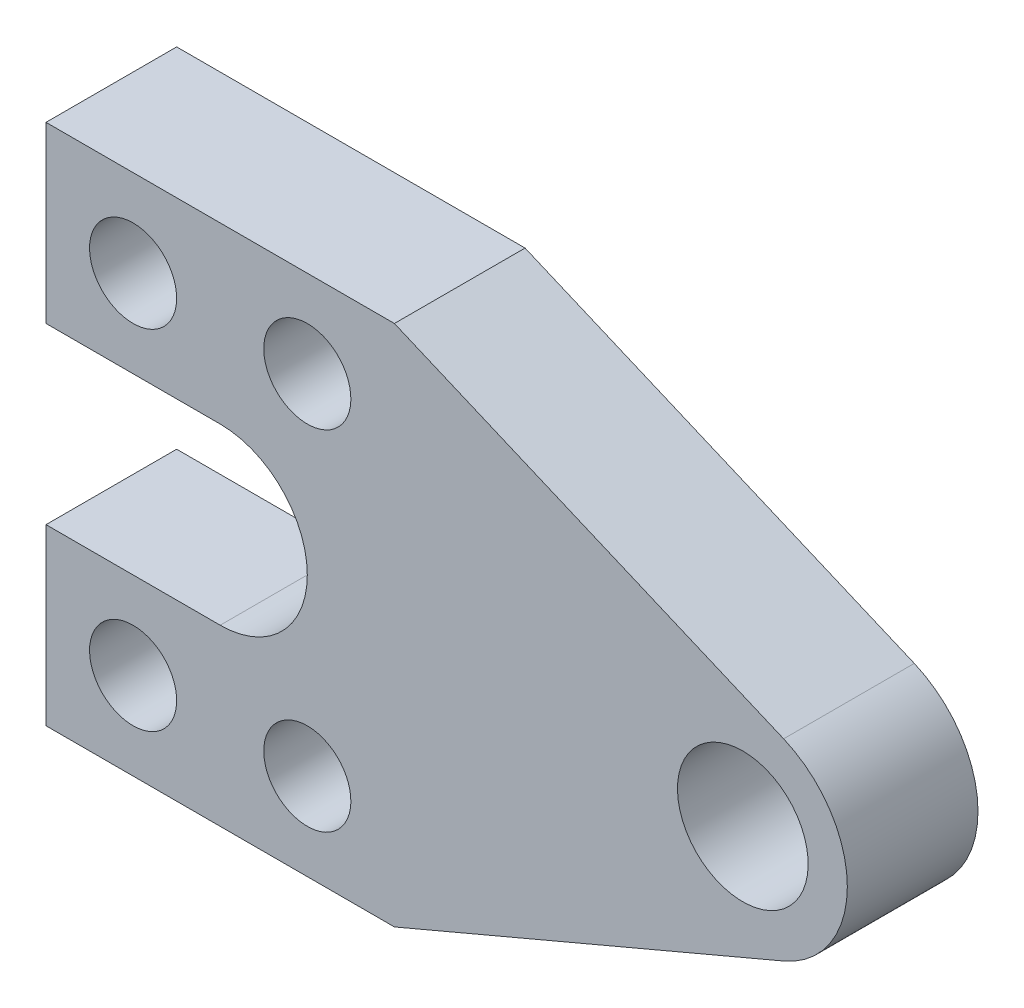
ISO-10303-21;
HEADER;
FILE_DESCRIPTION(('STEP AP214'),'2;1');
FILE_NAME('part.step','',(''),(''),'','','');
FILE_SCHEMA(('AUTOMOTIVE_DESIGN { 1 0 10303 214 1 1 1 1 }'));
ENDSEC;
DATA;
#1=APPLICATION_CONTEXT('core data for automotive mechanical design processes');
#2=APPLICATION_PROTOCOL_DEFINITION('international standard','automotive_design',2000,#1);
#3=PRODUCT_CONTEXT('',#1,'mechanical');
#4=PRODUCT('Part','Part','',(#3));
#5=PRODUCT_RELATED_PRODUCT_CATEGORY('part','',(#4));
#6=PRODUCT_DEFINITION_FORMATION('','',#4);
#7=PRODUCT_DEFINITION_CONTEXT('part definition',#1,'design');
#8=PRODUCT_DEFINITION('design','',#6,#7);
#9=PRODUCT_DEFINITION_SHAPE('','',#8);
#10=(LENGTH_UNIT() NAMED_UNIT(*) SI_UNIT(.MILLI.,.METRE.));
#11=(NAMED_UNIT(*) PLANE_ANGLE_UNIT() SI_UNIT($,.RADIAN.));
#12=(NAMED_UNIT(*) SI_UNIT($,.STERADIAN.) SOLID_ANGLE_UNIT());
#13=UNCERTAINTY_MEASURE_WITH_UNIT(LENGTH_MEASURE(1.E-05),#10,'distance_accuracy_value','');
#14=(GEOMETRIC_REPRESENTATION_CONTEXT(3) GLOBAL_UNCERTAINTY_ASSIGNED_CONTEXT((#13)) GLOBAL_UNIT_ASSIGNED_CONTEXT((#10,
#11,#12)) REPRESENTATION_CONTEXT('',''));
#15=CARTESIAN_POINT('',(0.,0.,0.));
#16=DIRECTION('',(0.,0.,1.));
#17=DIRECTION('',(1.,0.,0.));
#18=AXIS2_PLACEMENT_3D('',#15,#16,#17);
#19=CARTESIAN_POINT('',(9.99999999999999,-9.99999999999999,-7.5));
#20=DIRECTION('',(1.,0.,0.));
#21=DIRECTION('',(0.,1.,0.));
#22=AXIS2_PLACEMENT_3D('',#19,#20,#21);
#23=PLANE('',#22);
#24=DIRECTION('',(0.,1.,0.));
#25=VECTOR('',#24,1.);
#26=CARTESIAN_POINT('',(9.99999999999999,-9.99999999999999,7.5));
#27=LINE('',#26,#25);
#28=CARTESIAN_POINT('',(10.,-30.,7.5));
#29=VERTEX_POINT('',#28);
#30=CARTESIAN_POINT('',(9.99999999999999,-9.99999999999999,7.5));
#31=VERTEX_POINT('',#30);
#32=EDGE_CURVE('E142',#29,#31,#27,.T.);
#33=ORIENTED_EDGE('',*,*,#32,.T.);
#34=DIRECTION('',(0.,0.,1.));
#35=VECTOR('',#34,1.);
#36=CARTESIAN_POINT('',(9.99999999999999,-9.99999999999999,-7.5));
#37=LINE('',#36,#35);
#38=CARTESIAN_POINT('',(9.99999999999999,-9.99999999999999,-7.5));
#39=VERTEX_POINT('',#38);
#40=EDGE_CURVE('E180',#39,#31,#37,.T.);
#41=ORIENTED_EDGE('',*,*,#40,.F.);
#42=DIRECTION('',(0.,1.,0.));
#43=VECTOR('',#42,1.);
#44=CARTESIAN_POINT('',(9.99999999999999,-9.99999999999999,-7.5));
#45=LINE('',#44,#43);
#46=CARTESIAN_POINT('',(10.,-30.,-7.5));
#47=VERTEX_POINT('',#46);
#48=EDGE_CURVE('E161',#47,#39,#45,.T.);
#49=ORIENTED_EDGE('',*,*,#48,.F.);
#50=DIRECTION('',(0.,0.,1.));
#51=VECTOR('',#50,1.);
#52=CARTESIAN_POINT('',(10.,-30.,-7.5));
#53=LINE('',#52,#51);
#54=EDGE_CURVE('E138',#47,#29,#53,.T.);
#55=ORIENTED_EDGE('',*,*,#54,.T.);
#56=EDGE_LOOP('',(#33,#41,#49,#55));
#57=FACE_BOUND('',#56,.T.);
#58=ADVANCED_FACE('F31',(#57),#23,.F.);
#59=CARTESIAN_POINT('',(50.,-9.99999999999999,-7.5));
#60=DIRECTION('',(0.,-1.,0.));
#61=DIRECTION('',(1.,0.,0.));
#62=AXIS2_PLACEMENT_3D('',#59,#60,#61);
#63=PLANE('',#62);
#64=DIRECTION('',(1.,0.,0.));
#65=VECTOR('',#64,1.);
#66=CARTESIAN_POINT('',(50.,-9.99999999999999,7.5));
#67=LINE('',#66,#65);
#68=CARTESIAN_POINT('',(50.,-9.99999999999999,7.5));
#69=VERTEX_POINT('',#68);
#70=EDGE_CURVE('E145',#31,#69,#67,.T.);
#71=ORIENTED_EDGE('',*,*,#70,.T.);
#72=DIRECTION('',(0.,0.,1.));
#73=VECTOR('',#72,1.);
#74=CARTESIAN_POINT('',(50.,-9.99999999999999,-7.5));
#75=LINE('',#74,#73);
#76=CARTESIAN_POINT('',(50.,-9.99999999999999,-7.5));
#77=VERTEX_POINT('',#76);
#78=EDGE_CURVE('E177',#77,#69,#75,.T.);
#79=ORIENTED_EDGE('',*,*,#78,.F.);
#80=DIRECTION('',(1.,0.,0.));
#81=VECTOR('',#80,1.);
#82=CARTESIAN_POINT('',(50.,-9.99999999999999,-7.5));
#83=LINE('',#82,#81);
#84=EDGE_CURVE('E98',#39,#77,#83,.T.);
#85=ORIENTED_EDGE('',*,*,#84,.F.);
#86=ORIENTED_EDGE('',*,*,#40,.T.);
#87=EDGE_LOOP('',(#71,#79,#85,#86));
#88=FACE_BOUND('',#87,.T.);
#89=ADVANCED_FACE('F209',(#88),#63,.F.);
#90=CARTESIAN_POINT('',(94.6855647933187,-28.9525802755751,-7.5));
#91=DIRECTION('',(-0.390463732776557,-0.920618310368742,0.));
#92=DIRECTION('',(0.920618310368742,-0.390463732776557,0.));
#93=AXIS2_PLACEMENT_3D('',#90,#91,#92);
#94=PLANE('',#93);
#95=DIRECTION('',(0.920618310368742,-0.390463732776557,0.));
#96=VECTOR('',#95,1.);
#97=CARTESIAN_POINT('',(94.6855647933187,-28.9525802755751,7.5));
#98=LINE('',#97,#96);
#99=CARTESIAN_POINT('',(94.6855647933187,-28.9525802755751,7.5));
#100=VERTEX_POINT('',#99);
#101=EDGE_CURVE('E148',#69,#100,#98,.T.);
#102=ORIENTED_EDGE('',*,*,#101,.T.);
#103=DIRECTION('',(0.,0.,1.));
#104=VECTOR('',#103,1.);
#105=CARTESIAN_POINT('',(94.6855647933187,-28.9525802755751,-7.5));
#106=LINE('',#105,#104);
#107=CARTESIAN_POINT('',(94.6855647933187,-28.9525802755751,-7.5));
#108=VERTEX_POINT('',#107);
#109=EDGE_CURVE('E174',#108,#100,#106,.T.);
#110=ORIENTED_EDGE('',*,*,#109,.F.);
#111=DIRECTION('',(0.920618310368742,-0.390463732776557,0.));
#112=VECTOR('',#111,1.);
#113=CARTESIAN_POINT('',(94.6855647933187,-28.9525802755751,-7.5));
#114=LINE('',#113,#112);
#115=EDGE_CURVE('E267',#77,#108,#114,.T.);
#116=ORIENTED_EDGE('',*,*,#115,.F.);
#117=ORIENTED_EDGE('',*,*,#78,.T.);
#118=EDGE_LOOP('',(#102,#110,#116,#117));
#119=FACE_BOUND('',#118,.T.);
#120=ADVANCED_FACE('F215',(#119),#94,.F.);
#121=CARTESIAN_POINT('',(90.,-40.,-7.5));
#122=DIRECTION('',(0.,0.,1.));
#123=DIRECTION('',(1.,0.,0.));
#124=AXIS2_PLACEMENT_3D('',#121,#122,#123);
#125=CYLINDRICAL_SURFACE('',#124,12.);
#126=CARTESIAN_POINT('',(90.,-40.,7.5));
#127=DIRECTION('',(0.,0.,-1.));
#128=DIRECTION('',(1.,0.,0.));
#129=AXIS2_PLACEMENT_3D('',#126,#127,#128);
#130=CIRCLE('',#129,12.);
#131=CARTESIAN_POINT('',(94.6855647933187,-51.0474197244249,7.5));
#132=VERTEX_POINT('',#131);
#133=EDGE_CURVE('E150',#100,#132,#130,.T.);
#134=ORIENTED_EDGE('',*,*,#133,.T.);
#135=DIRECTION('',(0.,0.,1.));
#136=VECTOR('',#135,1.);
#137=CARTESIAN_POINT('',(94.6855647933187,-51.0474197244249,-7.5));
#138=LINE('',#137,#136);
#139=CARTESIAN_POINT('',(94.6855647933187,-51.0474197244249,-7.5));
#140=VERTEX_POINT('',#139);
#141=EDGE_CURVE('E171',#140,#132,#138,.T.);
#142=ORIENTED_EDGE('',*,*,#141,.F.);
#143=CARTESIAN_POINT('',(90.,-40.,-7.5));
#144=DIRECTION('',(0.,0.,-1.));
#145=DIRECTION('',(1.,0.,0.));
#146=AXIS2_PLACEMENT_3D('',#143,#144,#145);
#147=CIRCLE('',#146,12.);
#148=EDGE_CURVE('E269',#108,#140,#147,.T.);
#149=ORIENTED_EDGE('',*,*,#148,.F.);
#150=ORIENTED_EDGE('',*,*,#109,.T.);
#151=EDGE_LOOP('',(#134,#142,#149,#150));
#152=FACE_BOUND('',#151,.T.);
#153=ADVANCED_FACE('F296',(#152),#125,.T.);
#154=CARTESIAN_POINT('',(50.,-70.,-7.5));
#155=DIRECTION('',(-0.390463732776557,0.920618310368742,0.));
#156=DIRECTION('',(-0.920618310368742,-0.390463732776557,0.));
#157=AXIS2_PLACEMENT_3D('',#154,#155,#156);
#158=PLANE('',#157);
#159=DIRECTION('',(-0.920618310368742,-0.390463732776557,0.));
#160=VECTOR('',#159,1.);
#161=CARTESIAN_POINT('',(50.,-70.,7.5));
#162=LINE('',#161,#160);
#163=CARTESIAN_POINT('',(50.,-70.,7.5));
#164=VERTEX_POINT('',#163);
#165=EDGE_CURVE('E152',#132,#164,#162,.T.);
#166=ORIENTED_EDGE('',*,*,#165,.T.);
#167=DIRECTION('',(0.,0.,1.));
#168=VECTOR('',#167,1.);
#169=CARTESIAN_POINT('',(50.,-70.,-7.5));
#170=LINE('',#169,#168);
#171=CARTESIAN_POINT('',(50.,-70.,-7.5));
#172=VERTEX_POINT('',#171);
#173=EDGE_CURVE('E168',#172,#164,#170,.T.);
#174=ORIENTED_EDGE('',*,*,#173,.F.);
#175=DIRECTION('',(-0.920618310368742,-0.390463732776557,0.));
#176=VECTOR('',#175,1.);
#177=CARTESIAN_POINT('',(50.,-70.,-7.5));
#178=LINE('',#177,#176);
#179=EDGE_CURVE('E271',#140,#172,#178,.T.);
#180=ORIENTED_EDGE('',*,*,#179,.F.);
#181=ORIENTED_EDGE('',*,*,#141,.T.);
#182=EDGE_LOOP('',(#166,#174,#180,#181));
#183=FACE_BOUND('',#182,.T.);
#184=ADVANCED_FACE('F299',(#183),#158,.F.);
#185=CARTESIAN_POINT('',(9.99999999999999,-70.,-7.5));
#186=DIRECTION('',(0.,1.,0.));
#187=DIRECTION('',(0.,0.,1.));
#188=AXIS2_PLACEMENT_3D('',#185,#186,#187);
#189=PLANE('',#188);
#190=DIRECTION('',(-1.,0.,0.));
#191=VECTOR('',#190,1.);
#192=CARTESIAN_POINT('',(9.99999999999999,-70.,7.5));
#193=LINE('',#192,#191);
#194=CARTESIAN_POINT('',(9.99999999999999,-70.,7.5));
#195=VERTEX_POINT('',#194);
#196=EDGE_CURVE('E154',#164,#195,#193,.T.);
#197=ORIENTED_EDGE('',*,*,#196,.T.);
#198=DIRECTION('',(0.,0.,1.));
#199=VECTOR('',#198,1.);
#200=CARTESIAN_POINT('',(9.99999999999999,-70.,-7.5));
#201=LINE('',#200,#199);
#202=CARTESIAN_POINT('',(9.99999999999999,-70.,-7.5));
#203=VERTEX_POINT('',#202);
#204=EDGE_CURVE('E165',#203,#195,#201,.T.);
#205=ORIENTED_EDGE('',*,*,#204,.F.);
#206=DIRECTION('',(-1.,0.,0.));
#207=VECTOR('',#206,1.);
#208=CARTESIAN_POINT('',(9.99999999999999,-70.,-7.5));
#209=LINE('',#208,#207);
#210=EDGE_CURVE('E273',#172,#203,#209,.T.);
#211=ORIENTED_EDGE('',*,*,#210,.F.);
#212=ORIENTED_EDGE('',*,*,#173,.T.);
#213=EDGE_LOOP('',(#197,#205,#211,#212));
#214=FACE_BOUND('',#213,.T.);
#215=ADVANCED_FACE('F279',(#214),#189,.F.);
#216=CARTESIAN_POINT('',(9.99999999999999,-50.,-7.5));
#217=DIRECTION('',(1.,0.,0.));
#218=DIRECTION('',(0.,1.,0.));
#219=AXIS2_PLACEMENT_3D('',#216,#217,#218);
#220=PLANE('',#219);
#221=DIRECTION('',(0.,1.,0.));
#222=VECTOR('',#221,1.);
#223=CARTESIAN_POINT('',(9.99999999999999,-50.,7.5));
#224=LINE('',#223,#222);
#225=CARTESIAN_POINT('',(9.99999999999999,-50.,7.5));
#226=VERTEX_POINT('',#225);
#227=EDGE_CURVE('E156',#195,#226,#224,.T.);
#228=ORIENTED_EDGE('',*,*,#227,.T.);
#229=DIRECTION('',(0.,0.,1.));
#230=VECTOR('',#229,1.);
#231=CARTESIAN_POINT('',(9.99999999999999,-50.,-7.5));
#232=LINE('',#231,#230);
#233=CARTESIAN_POINT('',(9.99999999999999,-50.,-7.5));
#234=VERTEX_POINT('',#233);
#235=EDGE_CURVE('E133',#234,#226,#232,.T.);
#236=ORIENTED_EDGE('',*,*,#235,.F.);
#237=DIRECTION('',(0.,1.,0.));
#238=VECTOR('',#237,1.);
#239=CARTESIAN_POINT('',(9.99999999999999,-50.,-7.5));
#240=LINE('',#239,#238);
#241=EDGE_CURVE('E124',#203,#234,#240,.T.);
#242=ORIENTED_EDGE('',*,*,#241,.F.);
#243=ORIENTED_EDGE('',*,*,#204,.T.);
#244=EDGE_LOOP('',(#228,#236,#242,#243));
#245=FACE_BOUND('',#244,.T.);
#246=ADVANCED_FACE('F283',(#245),#220,.F.);
#247=CARTESIAN_POINT('',(30.,-50.,-7.5));
#248=DIRECTION('',(0.,-1.,0.));
#249=DIRECTION('',(1.,0.,0.));
#250=AXIS2_PLACEMENT_3D('',#247,#248,#249);
#251=PLANE('',#250);
#252=DIRECTION('',(1.,0.,0.));
#253=VECTOR('',#252,1.);
#254=CARTESIAN_POINT('',(30.,-50.,7.5));
#255=LINE('',#254,#253);
#256=CARTESIAN_POINT('',(30.,-50.,7.5));
#257=VERTEX_POINT('',#256);
#258=EDGE_CURVE('E132',#226,#257,#255,.T.);
#259=ORIENTED_EDGE('',*,*,#258,.T.);
#260=DIRECTION('',(0.,0.,1.));
#261=VECTOR('',#260,1.);
#262=CARTESIAN_POINT('',(30.,-50.,-7.5));
#263=LINE('',#262,#261);
#264=CARTESIAN_POINT('',(30.,-50.,-7.5));
#265=VERTEX_POINT('',#264);
#266=EDGE_CURVE('E129',#265,#257,#263,.T.);
#267=ORIENTED_EDGE('',*,*,#266,.F.);
#268=DIRECTION('',(1.,0.,0.));
#269=VECTOR('',#268,1.);
#270=CARTESIAN_POINT('',(30.,-50.,-7.5));
#271=LINE('',#270,#269);
#272=EDGE_CURVE('E117',#234,#265,#271,.T.);
#273=ORIENTED_EDGE('',*,*,#272,.F.);
#274=ORIENTED_EDGE('',*,*,#235,.T.);
#275=EDGE_LOOP('',(#259,#267,#273,#274));
#276=FACE_BOUND('',#275,.T.);
#277=ADVANCED_FACE('F130',(#276),#251,.F.);
#278=CARTESIAN_POINT('',(30.,-40.,-7.5));
#279=DIRECTION('',(0.,0.,1.));
#280=DIRECTION('',(1.,0.,0.));
#281=AXIS2_PLACEMENT_3D('',#278,#279,#280);
#282=CYLINDRICAL_SURFACE('',#281,10.);
#283=CARTESIAN_POINT('',(30.,-40.,7.5));
#284=DIRECTION('',(0.,0.,1.));
#285=DIRECTION('',(-1.,0.,0.));
#286=AXIS2_PLACEMENT_3D('',#283,#284,#285);
#287=CIRCLE('',#286,10.);
#288=CARTESIAN_POINT('',(30.,-30.,7.5));
#289=VERTEX_POINT('',#288);
#290=EDGE_CURVE('E83',#257,#289,#287,.T.);
#291=ORIENTED_EDGE('',*,*,#290,.T.);
#292=DIRECTION('',(0.,0.,1.));
#293=VECTOR('',#292,1.);
#294=CARTESIAN_POINT('',(30.,-30.,-7.5));
#295=LINE('',#294,#293);
#296=CARTESIAN_POINT('',(30.,-30.,-7.5));
#297=VERTEX_POINT('',#296);
#298=EDGE_CURVE('E134',#297,#289,#295,.T.);
#299=ORIENTED_EDGE('',*,*,#298,.F.);
#300=CARTESIAN_POINT('',(30.,-40.,-7.5));
#301=DIRECTION('',(0.,0.,1.));
#302=DIRECTION('',(-1.,0.,0.));
#303=AXIS2_PLACEMENT_3D('',#300,#301,#302);
#304=CIRCLE('',#303,10.);
#305=EDGE_CURVE('E122',#265,#297,#304,.T.);
#306=ORIENTED_EDGE('',*,*,#305,.F.);
#307=ORIENTED_EDGE('',*,*,#266,.T.);
#308=EDGE_LOOP('',(#291,#299,#306,#307));
#309=FACE_BOUND('',#308,.T.);
#310=ADVANCED_FACE('F136',(#309),#282,.F.);
#311=CARTESIAN_POINT('',(10.,-30.,-7.5));
#312=DIRECTION('',(0.,1.,0.));
#313=DIRECTION('',(0.,0.,1.));
#314=AXIS2_PLACEMENT_3D('',#311,#312,#313);
#315=PLANE('',#314);
#316=DIRECTION('',(-1.,0.,0.));
#317=VECTOR('',#316,1.);
#318=CARTESIAN_POINT('',(10.,-30.,7.5));
#319=LINE('',#318,#317);
#320=EDGE_CURVE('E89',#289,#29,#319,.T.);
#321=ORIENTED_EDGE('',*,*,#320,.T.);
#322=ORIENTED_EDGE('',*,*,#54,.F.);
#323=DIRECTION('',(-1.,0.,0.));
#324=VECTOR('',#323,1.);
#325=CARTESIAN_POINT('',(10.,-30.,-7.5));
#326=LINE('',#325,#324);
#327=EDGE_CURVE('E48',#297,#47,#326,.T.);
#328=ORIENTED_EDGE('',*,*,#327,.F.);
#329=ORIENTED_EDGE('',*,*,#298,.T.);
#330=EDGE_LOOP('',(#321,#322,#328,#329));
#331=FACE_BOUND('',#330,.T.);
#332=ADVANCED_FACE('F194',(#331),#315,.F.);
#333=CARTESIAN_POINT('',(30.,-40.,-7.5));
#334=DIRECTION('',(0.,0.,-1.));
#335=DIRECTION('',(-1.,0.,0.));
#336=AXIS2_PLACEMENT_3D('',#333,#334,#335);
#337=PLANE('',#336);
#338=CARTESIAN_POINT('',(90.,-40.,-7.5));
#339=DIRECTION('',(0.,0.,-1.));
#340=DIRECTION('',(0.,1.,0.));
#341=AXIS2_PLACEMENT_3D('',#338,#339,#340);
#342=CIRCLE('',#341,7.5);
#343=CARTESIAN_POINT('',(90.,-32.5,-7.5));
#344=VERTEX_POINT('',#343);
#345=EDGE_CURVE('E248',#344,#344,#342,.T.);
#346=ORIENTED_EDGE('',*,*,#345,.F.);
#347=EDGE_LOOP('',(#346));
#348=FACE_BOUND('',#347,.T.);
#349=CARTESIAN_POINT('',(40.,-60.,-7.5));
#350=DIRECTION('',(0.,0.,-1.));
#351=DIRECTION('',(0.,1.,0.));
#352=AXIS2_PLACEMENT_3D('',#349,#350,#351);
#353=CIRCLE('',#352,5.);
#354=CARTESIAN_POINT('',(40.,-55.,-7.5));
#355=VERTEX_POINT('',#354);
#356=EDGE_CURVE('E252',#355,#355,#353,.T.);
#357=ORIENTED_EDGE('',*,*,#356,.F.);
#358=EDGE_LOOP('',(#357));
#359=FACE_BOUND('',#358,.T.);
#360=CARTESIAN_POINT('',(20.,-60.,-7.5));
#361=DIRECTION('',(0.,0.,-1.));
#362=DIRECTION('',(0.,1.,0.));
#363=AXIS2_PLACEMENT_3D('',#360,#361,#362);
#364=CIRCLE('',#363,5.);
#365=CARTESIAN_POINT('',(20.,-55.,-7.5));
#366=VERTEX_POINT('',#365);
#367=EDGE_CURVE('E260',#366,#366,#364,.T.);
#368=ORIENTED_EDGE('',*,*,#367,.F.);
#369=EDGE_LOOP('',(#368));
#370=FACE_BOUND('',#369,.T.);
#371=ORIENTED_EDGE('',*,*,#48,.T.);
#372=ORIENTED_EDGE('',*,*,#84,.T.);
#373=ORIENTED_EDGE('',*,*,#115,.T.);
#374=ORIENTED_EDGE('',*,*,#148,.T.);
#375=ORIENTED_EDGE('',*,*,#179,.T.);
#376=ORIENTED_EDGE('',*,*,#210,.T.);
#377=ORIENTED_EDGE('',*,*,#241,.T.);
#378=ORIENTED_EDGE('',*,*,#272,.T.);
#379=ORIENTED_EDGE('',*,*,#305,.T.);
#380=ORIENTED_EDGE('',*,*,#327,.T.);
#381=EDGE_LOOP('',(#371,#372,#373,#374,#375,#376,#377,#378,#379,#380));
#382=FACE_BOUND('',#381,.T.);
#383=CARTESIAN_POINT('',(20.,-20.,-7.5));
#384=DIRECTION('',(0.,0.,-1.));
#385=DIRECTION('',(0.,1.,0.));
#386=AXIS2_PLACEMENT_3D('',#383,#384,#385);
#387=CIRCLE('',#386,5.);
#388=CARTESIAN_POINT('',(20.,-15.,-7.5));
#389=VERTEX_POINT('',#388);
#390=EDGE_CURVE('E182',#389,#389,#387,.T.);
#391=ORIENTED_EDGE('',*,*,#390,.F.);
#392=EDGE_LOOP('',(#391));
#393=FACE_BOUND('',#392,.T.);
#394=CARTESIAN_POINT('',(40.,-20.,-7.5));
#395=DIRECTION('',(0.,0.,-1.));
#396=DIRECTION('',(0.,1.,0.));
#397=AXIS2_PLACEMENT_3D('',#394,#395,#396);
#398=CIRCLE('',#397,5.);
#399=CARTESIAN_POINT('',(40.,-15.,-7.5));
#400=VERTEX_POINT('',#399);
#401=EDGE_CURVE('E40',#400,#400,#398,.T.);
#402=ORIENTED_EDGE('',*,*,#401,.F.);
#403=EDGE_LOOP('',(#402));
#404=FACE_BOUND('',#403,.T.);
#405=ADVANCED_FACE('F119',(#348,#359,#370,#382,#393,#404),#337,.T.);
#406=CARTESIAN_POINT('',(30.,-40.,7.5));
#407=DIRECTION('',(0.,0.,-1.));
#408=DIRECTION('',(-1.,0.,0.));
#409=AXIS2_PLACEMENT_3D('',#406,#407,#408);
#410=PLANE('',#409);
#411=CARTESIAN_POINT('',(90.,-40.,7.5));
#412=DIRECTION('',(0.,0.,-1.));
#413=DIRECTION('',(-1.,0.,0.));
#414=AXIS2_PLACEMENT_3D('',#411,#412,#413);
#415=CIRCLE('',#414,7.5);
#416=CARTESIAN_POINT('',(90.,-32.5,7.5));
#417=VERTEX_POINT('',#416);
#418=EDGE_CURVE('E251',#417,#417,#415,.F.);
#419=ORIENTED_EDGE('',*,*,#418,.F.);
#420=EDGE_LOOP('',(#419));
#421=FACE_BOUND('',#420,.T.);
#422=CARTESIAN_POINT('',(40.,-60.,7.5));
#423=DIRECTION('',(0.,0.,-1.));
#424=DIRECTION('',(-1.,0.,0.));
#425=AXIS2_PLACEMENT_3D('',#422,#423,#424);
#426=CIRCLE('',#425,5.);
#427=CARTESIAN_POINT('',(40.,-55.,7.5));
#428=VERTEX_POINT('',#427);
#429=EDGE_CURVE('E254',#428,#428,#426,.F.);
#430=ORIENTED_EDGE('',*,*,#429,.F.);
#431=EDGE_LOOP('',(#430));
#432=FACE_BOUND('',#431,.T.);
#433=CARTESIAN_POINT('',(20.,-60.,7.5));
#434=DIRECTION('',(0.,0.,-1.));
#435=DIRECTION('',(-1.,0.,0.));
#436=AXIS2_PLACEMENT_3D('',#433,#434,#435);
#437=CIRCLE('',#436,5.);
#438=CARTESIAN_POINT('',(20.,-55.,7.5));
#439=VERTEX_POINT('',#438);
#440=EDGE_CURVE('E146',#439,#439,#437,.F.);
#441=ORIENTED_EDGE('',*,*,#440,.F.);
#442=EDGE_LOOP('',(#441));
#443=FACE_BOUND('',#442,.T.);
#444=ORIENTED_EDGE('',*,*,#32,.F.);
#445=ORIENTED_EDGE('',*,*,#320,.F.);
#446=ORIENTED_EDGE('',*,*,#290,.F.);
#447=ORIENTED_EDGE('',*,*,#258,.F.);
#448=ORIENTED_EDGE('',*,*,#227,.F.);
#449=ORIENTED_EDGE('',*,*,#196,.F.);
#450=ORIENTED_EDGE('',*,*,#165,.F.);
#451=ORIENTED_EDGE('',*,*,#133,.F.);
#452=ORIENTED_EDGE('',*,*,#101,.F.);
#453=ORIENTED_EDGE('',*,*,#70,.F.);
#454=EDGE_LOOP('',(#444,#445,#446,#447,#448,#449,#450,#451,#452,#453));
#455=FACE_BOUND('',#454,.T.);
#456=CARTESIAN_POINT('',(20.,-20.,7.5));
#457=DIRECTION('',(0.,0.,-1.));
#458=DIRECTION('',(-1.,0.,0.));
#459=AXIS2_PLACEMENT_3D('',#456,#457,#458);
#460=CIRCLE('',#459,5.);
#461=CARTESIAN_POINT('',(20.,-15.,7.5));
#462=VERTEX_POINT('',#461);
#463=EDGE_CURVE('E185',#462,#462,#460,.F.);
#464=ORIENTED_EDGE('',*,*,#463,.F.);
#465=EDGE_LOOP('',(#464));
#466=FACE_BOUND('',#465,.T.);
#467=CARTESIAN_POINT('',(40.,-20.,7.5));
#468=DIRECTION('',(0.,0.,-1.));
#469=DIRECTION('',(-1.,0.,0.));
#470=AXIS2_PLACEMENT_3D('',#467,#468,#469);
#471=CIRCLE('',#470,5.);
#472=CARTESIAN_POINT('',(40.,-15.,7.5));
#473=VERTEX_POINT('',#472);
#474=EDGE_CURVE('E11',#473,#473,#471,.F.);
#475=ORIENTED_EDGE('',*,*,#474,.F.);
#476=EDGE_LOOP('',(#475));
#477=FACE_BOUND('',#476,.T.);
#478=ADVANCED_FACE('F193',(#421,#432,#443,#455,#466,#477),#410,.F.);
#479=CARTESIAN_POINT('',(20.,-60.,7.501));
#480=DIRECTION('',(0.,0.,-1.));
#481=DIRECTION('',(0.,1.,0.));
#482=AXIS2_PLACEMENT_3D('',#479,#480,#481);
#483=CYLINDRICAL_SURFACE('',#482,5.);
#484=CARTESIAN_POINT('',(20.,-55.,-7.5));
#485=CARTESIAN_POINT('',(20.,-55.,-7.34375));
#486=CARTESIAN_POINT('',(20.,-55.,-7.1875));
#487=CARTESIAN_POINT('',(20.,-55.,-6.875));
#488=CARTESIAN_POINT('',(20.,-55.,-6.71875));
#489=CARTESIAN_POINT('',(20.,-55.,-6.40625));
#490=CARTESIAN_POINT('',(20.,-55.,-6.25));
#491=CARTESIAN_POINT('',(20.,-55.,-5.9375));
#492=CARTESIAN_POINT('',(20.,-55.,-5.78125));
#493=CARTESIAN_POINT('',(20.,-55.,-5.46875));
#494=CARTESIAN_POINT('',(20.,-55.,-5.3125));
#495=CARTESIAN_POINT('',(20.,-55.,-5.));
#496=CARTESIAN_POINT('',(20.,-55.,-4.84375));
#497=CARTESIAN_POINT('',(20.,-55.,-4.53125));
#498=CARTESIAN_POINT('',(20.,-55.,-4.375));
#499=CARTESIAN_POINT('',(20.,-55.,-4.0625));
#500=CARTESIAN_POINT('',(20.,-55.,-3.90625));
#501=CARTESIAN_POINT('',(20.,-55.,-3.59375));
#502=CARTESIAN_POINT('',(20.,-55.,-3.4375));
#503=CARTESIAN_POINT('',(20.,-55.,-3.125));
#504=CARTESIAN_POINT('',(20.,-55.,-2.96875));
#505=CARTESIAN_POINT('',(20.,-55.,-2.65625));
#506=CARTESIAN_POINT('',(20.,-55.,-2.5));
#507=CARTESIAN_POINT('',(20.,-55.,-2.1875));
#508=CARTESIAN_POINT('',(20.,-55.,-2.03125));
#509=CARTESIAN_POINT('',(20.,-55.,-1.71875));
#510=CARTESIAN_POINT('',(20.,-55.,-1.5625));
#511=CARTESIAN_POINT('',(20.,-55.,-1.25));
#512=CARTESIAN_POINT('',(20.,-55.,-1.09375));
#513=CARTESIAN_POINT('',(20.,-55.,-0.781250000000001));
#514=CARTESIAN_POINT('',(20.,-55.,-0.625000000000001));
#515=CARTESIAN_POINT('',(20.,-55.,-0.312500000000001));
#516=CARTESIAN_POINT('',(20.,-55.,-0.156250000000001));
#517=CARTESIAN_POINT('',(20.,-55.,0.156249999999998));
#518=CARTESIAN_POINT('',(20.,-55.,0.312499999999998));
#519=CARTESIAN_POINT('',(20.,-55.,0.624999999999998));
#520=CARTESIAN_POINT('',(20.,-55.,0.781249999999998));
#521=CARTESIAN_POINT('',(20.,-55.,1.09375));
#522=CARTESIAN_POINT('',(20.,-55.,1.25));
#523=CARTESIAN_POINT('',(20.,-55.,1.5625));
#524=CARTESIAN_POINT('',(20.,-55.,1.71875));
#525=CARTESIAN_POINT('',(20.,-55.,2.03125));
#526=CARTESIAN_POINT('',(20.,-55.,2.1875));
#527=CARTESIAN_POINT('',(20.,-55.,2.5));
#528=CARTESIAN_POINT('',(20.,-55.,2.65625));
#529=CARTESIAN_POINT('',(20.,-55.,2.96875));
#530=CARTESIAN_POINT('',(20.,-55.,3.125));
#531=CARTESIAN_POINT('',(20.,-55.,3.4375));
#532=CARTESIAN_POINT('',(20.,-55.,3.59375));
#533=CARTESIAN_POINT('',(20.,-55.,3.90625));
#534=CARTESIAN_POINT('',(20.,-55.,4.0625));
#535=CARTESIAN_POINT('',(20.,-55.,4.375));
#536=CARTESIAN_POINT('',(20.,-55.,4.53125));
#537=CARTESIAN_POINT('',(20.,-55.,4.84375));
#538=CARTESIAN_POINT('',(20.,-55.,5.));
#539=CARTESIAN_POINT('',(20.,-55.,5.3125));
#540=CARTESIAN_POINT('',(20.,-55.,5.46875));
#541=CARTESIAN_POINT('',(20.,-55.,5.78125));
#542=CARTESIAN_POINT('',(20.,-55.,5.9375));
#543=CARTESIAN_POINT('',(20.,-55.,6.25));
#544=CARTESIAN_POINT('',(20.,-55.,6.40625));
#545=CARTESIAN_POINT('',(20.,-55.,6.71875));
#546=CARTESIAN_POINT('',(20.,-55.,6.875));
#547=CARTESIAN_POINT('',(20.,-55.,7.1875));
#548=CARTESIAN_POINT('',(20.,-55.,7.34375));
#549=CARTESIAN_POINT('',(20.,-55.,7.5));
#550=B_SPLINE_CURVE_WITH_KNOTS('',3,(#484,#485,#486,#487,#488,#489,#490,#491,#492,#493,#494,
#495,#496,#497,#498,#499,#500,#501,#502,#503,#504,#505,#506,#507,#508,#509,#510,#511,#512,#513,
#514,#515,#516,#517,#518,#519,#520,#521,#522,#523,#524,#525,#526,#527,#528,#529,#530,#531,#532,
#533,#534,#535,#536,#537,#538,#539,#540,#541,#542,#543,#544,#545,#546,#547,#548,#549),
.UNSPECIFIED.,.F.,.F.,(4,2,2,2,2,2,2,2,2,2,2,2,2,2,2,2,2,2,2,2,2,2,2,2,2,2,2,2,2,2,2,2,4),(0.,
0.46875,0.937500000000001,1.40625,1.875,2.34375,2.8125,3.28125,3.75,4.21875,4.6875,5.15625,
5.625,6.09375,6.5625,7.03125,7.5,7.96875,8.4375,8.90625,9.375,9.84375,10.3125,10.78125,11.25,
11.71875,12.1875,12.65625,13.125,13.59375,14.0625,14.53125,15.),.UNSPECIFIED.);
#551=EDGE_CURVE('BSEAM201',#366,#439,#550,.T.);
#552=ORIENTED_EDGE('',*,*,#367,.T.);
#553=ORIENTED_EDGE('',*,*,#440,.T.);
#554=ORIENTED_EDGE('',*,*,#551,.T.);
#555=ORIENTED_EDGE('',*,*,#551,.F.);
#556=EDGE_LOOP('',(#552,#554,#553,#555));
#557=FACE_BOUND('',#556,.T.);
#558=ADVANCED_FACE('F201',(#557),#483,.F.);
#559=CARTESIAN_POINT('',(40.,-60.,7.501));
#560=DIRECTION('',(0.,0.,-1.));
#561=DIRECTION('',(0.,1.,0.));
#562=AXIS2_PLACEMENT_3D('',#559,#560,#561);
#563=CYLINDRICAL_SURFACE('',#562,5.);
#564=CARTESIAN_POINT('',(40.,-55.,-7.5));
#565=CARTESIAN_POINT('',(40.,-55.,-7.34375));
#566=CARTESIAN_POINT('',(40.,-55.,-7.1875));
#567=CARTESIAN_POINT('',(40.,-55.,-6.875));
#568=CARTESIAN_POINT('',(40.,-55.,-6.71875));
#569=CARTESIAN_POINT('',(40.,-55.,-6.40625));
#570=CARTESIAN_POINT('',(40.,-55.,-6.25));
#571=CARTESIAN_POINT('',(40.,-55.,-5.9375));
#572=CARTESIAN_POINT('',(40.,-55.,-5.78125));
#573=CARTESIAN_POINT('',(40.,-55.,-5.46875));
#574=CARTESIAN_POINT('',(40.,-55.,-5.3125));
#575=CARTESIAN_POINT('',(40.,-55.,-5.));
#576=CARTESIAN_POINT('',(40.,-55.,-4.84375));
#577=CARTESIAN_POINT('',(40.,-55.,-4.53125));
#578=CARTESIAN_POINT('',(40.,-55.,-4.375));
#579=CARTESIAN_POINT('',(40.,-55.,-4.0625));
#580=CARTESIAN_POINT('',(40.,-55.,-3.90625));
#581=CARTESIAN_POINT('',(40.,-55.,-3.59375));
#582=CARTESIAN_POINT('',(40.,-55.,-3.4375));
#583=CARTESIAN_POINT('',(40.,-55.,-3.125));
#584=CARTESIAN_POINT('',(40.,-55.,-2.96875));
#585=CARTESIAN_POINT('',(40.,-55.,-2.65625));
#586=CARTESIAN_POINT('',(40.,-55.,-2.5));
#587=CARTESIAN_POINT('',(40.,-55.,-2.1875));
#588=CARTESIAN_POINT('',(40.,-55.,-2.03125));
#589=CARTESIAN_POINT('',(40.,-55.,-1.71875));
#590=CARTESIAN_POINT('',(40.,-55.,-1.5625));
#591=CARTESIAN_POINT('',(40.,-55.,-1.25));
#592=CARTESIAN_POINT('',(40.,-55.,-1.09375));
#593=CARTESIAN_POINT('',(40.,-55.,-0.781250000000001));
#594=CARTESIAN_POINT('',(40.,-55.,-0.625000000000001));
#595=CARTESIAN_POINT('',(40.,-55.,-0.312500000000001));
#596=CARTESIAN_POINT('',(40.,-55.,-0.156250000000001));
#597=CARTESIAN_POINT('',(40.,-55.,0.156249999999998));
#598=CARTESIAN_POINT('',(40.,-55.,0.312499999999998));
#599=CARTESIAN_POINT('',(40.,-55.,0.624999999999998));
#600=CARTESIAN_POINT('',(40.,-55.,0.781249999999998));
#601=CARTESIAN_POINT('',(40.,-55.,1.09375));
#602=CARTESIAN_POINT('',(40.,-55.,1.25));
#603=CARTESIAN_POINT('',(40.,-55.,1.5625));
#604=CARTESIAN_POINT('',(40.,-55.,1.71875));
#605=CARTESIAN_POINT('',(40.,-55.,2.03125));
#606=CARTESIAN_POINT('',(40.,-55.,2.1875));
#607=CARTESIAN_POINT('',(40.,-55.,2.5));
#608=CARTESIAN_POINT('',(40.,-55.,2.65625));
#609=CARTESIAN_POINT('',(40.,-55.,2.96875));
#610=CARTESIAN_POINT('',(40.,-55.,3.125));
#611=CARTESIAN_POINT('',(40.,-55.,3.4375));
#612=CARTESIAN_POINT('',(40.,-55.,3.59375));
#613=CARTESIAN_POINT('',(40.,-55.,3.90625));
#614=CARTESIAN_POINT('',(40.,-55.,4.0625));
#615=CARTESIAN_POINT('',(40.,-55.,4.375));
#616=CARTESIAN_POINT('',(40.,-55.,4.53125));
#617=CARTESIAN_POINT('',(40.,-55.,4.84375));
#618=CARTESIAN_POINT('',(40.,-55.,5.));
#619=CARTESIAN_POINT('',(40.,-55.,5.3125));
#620=CARTESIAN_POINT('',(40.,-55.,5.46875));
#621=CARTESIAN_POINT('',(40.,-55.,5.78125));
#622=CARTESIAN_POINT('',(40.,-55.,5.9375));
#623=CARTESIAN_POINT('',(40.,-55.,6.25));
#624=CARTESIAN_POINT('',(40.,-55.,6.40625));
#625=CARTESIAN_POINT('',(40.,-55.,6.71875));
#626=CARTESIAN_POINT('',(40.,-55.,6.875));
#627=CARTESIAN_POINT('',(40.,-55.,7.1875));
#628=CARTESIAN_POINT('',(40.,-55.,7.34375));
#629=CARTESIAN_POINT('',(40.,-55.,7.5));
#630=B_SPLINE_CURVE_WITH_KNOTS('',3,(#564,#565,#566,#567,#568,#569,#570,#571,#572,#573,#574,
#575,#576,#577,#578,#579,#580,#581,#582,#583,#584,#585,#586,#587,#588,#589,#590,#591,#592,#593,
#594,#595,#596,#597,#598,#599,#600,#601,#602,#603,#604,#605,#606,#607,#608,#609,#610,#611,#612,
#613,#614,#615,#616,#617,#618,#619,#620,#621,#622,#623,#624,#625,#626,#627,#628,#629),
.UNSPECIFIED.,.F.,.F.,(4,2,2,2,2,2,2,2,2,2,2,2,2,2,2,2,2,2,2,2,2,2,2,2,2,2,2,2,2,2,2,2,4),(0.,
0.46875,0.937500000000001,1.40625,1.875,2.34375,2.8125,3.28125,3.75,4.21875,4.6875,5.15625,
5.625,6.09375,6.5625,7.03125,7.5,7.96875,8.4375,8.90625,9.375,9.84375,10.3125,10.78125,11.25,
11.71875,12.1875,12.65625,13.125,13.59375,14.0625,14.53125,15.),.UNSPECIFIED.);
#631=EDGE_CURVE('BSEAM220',#355,#428,#630,.T.);
#632=ORIENTED_EDGE('',*,*,#356,.T.);
#633=ORIENTED_EDGE('',*,*,#429,.T.);
#634=ORIENTED_EDGE('',*,*,#631,.T.);
#635=ORIENTED_EDGE('',*,*,#631,.F.);
#636=EDGE_LOOP('',(#632,#634,#633,#635));
#637=FACE_BOUND('',#636,.T.);
#638=ADVANCED_FACE('F220',(#637),#563,.F.);
#639=CARTESIAN_POINT('',(20.,-20.,7.501));
#640=DIRECTION('',(0.,0.,-1.));
#641=DIRECTION('',(0.,1.,0.));
#642=AXIS2_PLACEMENT_3D('',#639,#640,#641);
#643=CYLINDRICAL_SURFACE('',#642,5.);
#644=CARTESIAN_POINT('',(20.,-15.,-7.5));
#645=CARTESIAN_POINT('',(20.,-15.,-7.34375));
#646=CARTESIAN_POINT('',(20.,-15.,-7.1875));
#647=CARTESIAN_POINT('',(20.,-15.,-6.875));
#648=CARTESIAN_POINT('',(20.,-15.,-6.71875));
#649=CARTESIAN_POINT('',(20.,-15.,-6.40625));
#650=CARTESIAN_POINT('',(20.,-15.,-6.25));
#651=CARTESIAN_POINT('',(20.,-15.,-5.9375));
#652=CARTESIAN_POINT('',(20.,-15.,-5.78125));
#653=CARTESIAN_POINT('',(20.,-15.,-5.46875));
#654=CARTESIAN_POINT('',(20.,-15.,-5.3125));
#655=CARTESIAN_POINT('',(20.,-15.,-5.));
#656=CARTESIAN_POINT('',(20.,-15.,-4.84375));
#657=CARTESIAN_POINT('',(20.,-15.,-4.53125));
#658=CARTESIAN_POINT('',(20.,-15.,-4.375));
#659=CARTESIAN_POINT('',(20.,-15.,-4.0625));
#660=CARTESIAN_POINT('',(20.,-15.,-3.90625));
#661=CARTESIAN_POINT('',(20.,-15.,-3.59375));
#662=CARTESIAN_POINT('',(20.,-15.,-3.4375));
#663=CARTESIAN_POINT('',(20.,-15.,-3.125));
#664=CARTESIAN_POINT('',(20.,-15.,-2.96875));
#665=CARTESIAN_POINT('',(20.,-15.,-2.65625));
#666=CARTESIAN_POINT('',(20.,-15.,-2.5));
#667=CARTESIAN_POINT('',(20.,-15.,-2.1875));
#668=CARTESIAN_POINT('',(20.,-15.,-2.03125));
#669=CARTESIAN_POINT('',(20.,-15.,-1.71875));
#670=CARTESIAN_POINT('',(20.,-15.,-1.5625));
#671=CARTESIAN_POINT('',(20.,-15.,-1.25));
#672=CARTESIAN_POINT('',(20.,-15.,-1.09375));
#673=CARTESIAN_POINT('',(20.,-15.,-0.781250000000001));
#674=CARTESIAN_POINT('',(20.,-15.,-0.625000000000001));
#675=CARTESIAN_POINT('',(20.,-15.,-0.312500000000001));
#676=CARTESIAN_POINT('',(20.,-15.,-0.156250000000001));
#677=CARTESIAN_POINT('',(20.,-15.,0.156249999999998));
#678=CARTESIAN_POINT('',(20.,-15.,0.312499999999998));
#679=CARTESIAN_POINT('',(20.,-15.,0.624999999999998));
#680=CARTESIAN_POINT('',(20.,-15.,0.781249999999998));
#681=CARTESIAN_POINT('',(20.,-15.,1.09375));
#682=CARTESIAN_POINT('',(20.,-15.,1.25));
#683=CARTESIAN_POINT('',(20.,-15.,1.5625));
#684=CARTESIAN_POINT('',(20.,-15.,1.71875));
#685=CARTESIAN_POINT('',(20.,-15.,2.03125));
#686=CARTESIAN_POINT('',(20.,-15.,2.1875));
#687=CARTESIAN_POINT('',(20.,-15.,2.5));
#688=CARTESIAN_POINT('',(20.,-15.,2.65625));
#689=CARTESIAN_POINT('',(20.,-15.,2.96875));
#690=CARTESIAN_POINT('',(20.,-15.,3.125));
#691=CARTESIAN_POINT('',(20.,-15.,3.4375));
#692=CARTESIAN_POINT('',(20.,-15.,3.59375));
#693=CARTESIAN_POINT('',(20.,-15.,3.90625));
#694=CARTESIAN_POINT('',(20.,-15.,4.0625));
#695=CARTESIAN_POINT('',(20.,-15.,4.375));
#696=CARTESIAN_POINT('',(20.,-15.,4.53125));
#697=CARTESIAN_POINT('',(20.,-15.,4.84375));
#698=CARTESIAN_POINT('',(20.,-15.,5.));
#699=CARTESIAN_POINT('',(20.,-15.,5.3125));
#700=CARTESIAN_POINT('',(20.,-15.,5.46875));
#701=CARTESIAN_POINT('',(20.,-15.,5.78125));
#702=CARTESIAN_POINT('',(20.,-15.,5.9375));
#703=CARTESIAN_POINT('',(20.,-15.,6.25));
#704=CARTESIAN_POINT('',(20.,-15.,6.40625));
#705=CARTESIAN_POINT('',(20.,-15.,6.71875));
#706=CARTESIAN_POINT('',(20.,-15.,6.875));
#707=CARTESIAN_POINT('',(20.,-15.,7.1875));
#708=CARTESIAN_POINT('',(20.,-15.,7.34375));
#709=CARTESIAN_POINT('',(20.,-15.,7.5));
#710=B_SPLINE_CURVE_WITH_KNOTS('',3,(#644,#645,#646,#647,#648,#649,#650,#651,#652,#653,#654,
#655,#656,#657,#658,#659,#660,#661,#662,#663,#664,#665,#666,#667,#668,#669,#670,#671,#672,#673,
#674,#675,#676,#677,#678,#679,#680,#681,#682,#683,#684,#685,#686,#687,#688,#689,#690,#691,#692,
#693,#694,#695,#696,#697,#698,#699,#700,#701,#702,#703,#704,#705,#706,#707,#708,#709),
.UNSPECIFIED.,.F.,.F.,(4,2,2,2,2,2,2,2,2,2,2,2,2,2,2,2,2,2,2,2,2,2,2,2,2,2,2,2,2,2,2,2,4),(0.,
0.46875,0.937500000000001,1.40625,1.875,2.34375,2.8125,3.28125,3.75,4.21875,4.6875,5.15625,
5.625,6.09375,6.5625,7.03125,7.5,7.96875,8.4375,8.90625,9.375,9.84375,10.3125,10.78125,11.25,
11.71875,12.1875,12.65625,13.125,13.59375,14.0625,14.53125,15.),.UNSPECIFIED.);
#711=EDGE_CURVE('BSEAM218',#389,#462,#710,.T.);
#712=ORIENTED_EDGE('',*,*,#390,.T.);
#713=ORIENTED_EDGE('',*,*,#463,.T.);
#714=ORIENTED_EDGE('',*,*,#711,.T.);
#715=ORIENTED_EDGE('',*,*,#711,.F.);
#716=EDGE_LOOP('',(#712,#714,#713,#715));
#717=FACE_BOUND('',#716,.T.);
#718=ADVANCED_FACE('F218',(#717),#643,.F.);
#719=CARTESIAN_POINT('',(40.,-20.,7.501));
#720=DIRECTION('',(0.,0.,-1.));
#721=DIRECTION('',(0.,1.,0.));
#722=AXIS2_PLACEMENT_3D('',#719,#720,#721);
#723=CYLINDRICAL_SURFACE('',#722,5.);
#724=CARTESIAN_POINT('',(40.,-15.,-7.5));
#725=CARTESIAN_POINT('',(40.,-15.,-7.34375));
#726=CARTESIAN_POINT('',(40.,-15.,-7.1875));
#727=CARTESIAN_POINT('',(40.,-15.,-6.875));
#728=CARTESIAN_POINT('',(40.,-15.,-6.71875));
#729=CARTESIAN_POINT('',(40.,-15.,-6.40625));
#730=CARTESIAN_POINT('',(40.,-15.,-6.25));
#731=CARTESIAN_POINT('',(40.,-15.,-5.9375));
#732=CARTESIAN_POINT('',(40.,-15.,-5.78125));
#733=CARTESIAN_POINT('',(40.,-15.,-5.46875));
#734=CARTESIAN_POINT('',(40.,-15.,-5.3125));
#735=CARTESIAN_POINT('',(40.,-15.,-5.));
#736=CARTESIAN_POINT('',(40.,-15.,-4.84375));
#737=CARTESIAN_POINT('',(40.,-15.,-4.53125));
#738=CARTESIAN_POINT('',(40.,-15.,-4.375));
#739=CARTESIAN_POINT('',(40.,-15.,-4.0625));
#740=CARTESIAN_POINT('',(40.,-15.,-3.90625));
#741=CARTESIAN_POINT('',(40.,-15.,-3.59375));
#742=CARTESIAN_POINT('',(40.,-15.,-3.4375));
#743=CARTESIAN_POINT('',(40.,-15.,-3.125));
#744=CARTESIAN_POINT('',(40.,-15.,-2.96875));
#745=CARTESIAN_POINT('',(40.,-15.,-2.65625));
#746=CARTESIAN_POINT('',(40.,-15.,-2.5));
#747=CARTESIAN_POINT('',(40.,-15.,-2.1875));
#748=CARTESIAN_POINT('',(40.,-15.,-2.03125));
#749=CARTESIAN_POINT('',(40.,-15.,-1.71875));
#750=CARTESIAN_POINT('',(40.,-15.,-1.5625));
#751=CARTESIAN_POINT('',(40.,-15.,-1.25));
#752=CARTESIAN_POINT('',(40.,-15.,-1.09375));
#753=CARTESIAN_POINT('',(40.,-15.,-0.781250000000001));
#754=CARTESIAN_POINT('',(40.,-15.,-0.625000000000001));
#755=CARTESIAN_POINT('',(40.,-15.,-0.312500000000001));
#756=CARTESIAN_POINT('',(40.,-15.,-0.156250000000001));
#757=CARTESIAN_POINT('',(40.,-15.,0.156249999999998));
#758=CARTESIAN_POINT('',(40.,-15.,0.312499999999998));
#759=CARTESIAN_POINT('',(40.,-15.,0.624999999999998));
#760=CARTESIAN_POINT('',(40.,-15.,0.781249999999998));
#761=CARTESIAN_POINT('',(40.,-15.,1.09375));
#762=CARTESIAN_POINT('',(40.,-15.,1.25));
#763=CARTESIAN_POINT('',(40.,-15.,1.5625));
#764=CARTESIAN_POINT('',(40.,-15.,1.71875));
#765=CARTESIAN_POINT('',(40.,-15.,2.03125));
#766=CARTESIAN_POINT('',(40.,-15.,2.1875));
#767=CARTESIAN_POINT('',(40.,-15.,2.5));
#768=CARTESIAN_POINT('',(40.,-15.,2.65625));
#769=CARTESIAN_POINT('',(40.,-15.,2.96875));
#770=CARTESIAN_POINT('',(40.,-15.,3.125));
#771=CARTESIAN_POINT('',(40.,-15.,3.4375));
#772=CARTESIAN_POINT('',(40.,-15.,3.59375));
#773=CARTESIAN_POINT('',(40.,-15.,3.90625));
#774=CARTESIAN_POINT('',(40.,-15.,4.0625));
#775=CARTESIAN_POINT('',(40.,-15.,4.375));
#776=CARTESIAN_POINT('',(40.,-15.,4.53125));
#777=CARTESIAN_POINT('',(40.,-15.,4.84375));
#778=CARTESIAN_POINT('',(40.,-15.,5.));
#779=CARTESIAN_POINT('',(40.,-15.,5.3125));
#780=CARTESIAN_POINT('',(40.,-15.,5.46875));
#781=CARTESIAN_POINT('',(40.,-15.,5.78125));
#782=CARTESIAN_POINT('',(40.,-15.,5.9375));
#783=CARTESIAN_POINT('',(40.,-15.,6.25));
#784=CARTESIAN_POINT('',(40.,-15.,6.40625));
#785=CARTESIAN_POINT('',(40.,-15.,6.71875));
#786=CARTESIAN_POINT('',(40.,-15.,6.875));
#787=CARTESIAN_POINT('',(40.,-15.,7.1875));
#788=CARTESIAN_POINT('',(40.,-15.,7.34375));
#789=CARTESIAN_POINT('',(40.,-15.,7.5));
#790=B_SPLINE_CURVE_WITH_KNOTS('',3,(#724,#725,#726,#727,#728,#729,#730,#731,#732,#733,#734,
#735,#736,#737,#738,#739,#740,#741,#742,#743,#744,#745,#746,#747,#748,#749,#750,#751,#752,#753,
#754,#755,#756,#757,#758,#759,#760,#761,#762,#763,#764,#765,#766,#767,#768,#769,#770,#771,#772,
#773,#774,#775,#776,#777,#778,#779,#780,#781,#782,#783,#784,#785,#786,#787,#788,#789),
.UNSPECIFIED.,.F.,.F.,(4,2,2,2,2,2,2,2,2,2,2,2,2,2,2,2,2,2,2,2,2,2,2,2,2,2,2,2,2,2,2,2,4),(0.,
0.46875,0.937500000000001,1.40625,1.875,2.34375,2.8125,3.28125,3.75,4.21875,4.6875,5.15625,
5.625,6.09375,6.5625,7.03125,7.5,7.96875,8.4375,8.90625,9.375,9.84375,10.3125,10.78125,11.25,
11.71875,12.1875,12.65625,13.125,13.59375,14.0625,14.53125,15.),.UNSPECIFIED.);
#791=EDGE_CURVE('BSEAM33',#400,#473,#790,.T.);
#792=ORIENTED_EDGE('',*,*,#401,.T.);
#793=ORIENTED_EDGE('',*,*,#474,.T.);
#794=ORIENTED_EDGE('',*,*,#791,.T.);
#795=ORIENTED_EDGE('',*,*,#791,.F.);
#796=EDGE_LOOP('',(#792,#794,#793,#795));
#797=FACE_BOUND('',#796,.T.);
#798=ADVANCED_FACE('F33',(#797),#723,.F.);
#799=CARTESIAN_POINT('',(90.,-40.,7.501));
#800=DIRECTION('',(0.,0.,-1.));
#801=DIRECTION('',(0.,1.,0.));
#802=AXIS2_PLACEMENT_3D('',#799,#800,#801);
#803=CYLINDRICAL_SURFACE('',#802,7.5);
#804=CARTESIAN_POINT('',(90.,-32.5,-7.5));
#805=CARTESIAN_POINT('',(90.,-32.5,-7.34375));
#806=CARTESIAN_POINT('',(90.,-32.5,-7.1875));
#807=CARTESIAN_POINT('',(90.,-32.5,-6.875));
#808=CARTESIAN_POINT('',(90.,-32.5,-6.71875));
#809=CARTESIAN_POINT('',(90.,-32.5,-6.40625));
#810=CARTESIAN_POINT('',(90.,-32.5,-6.25));
#811=CARTESIAN_POINT('',(90.,-32.5,-5.9375));
#812=CARTESIAN_POINT('',(90.,-32.5,-5.78125));
#813=CARTESIAN_POINT('',(90.,-32.5,-5.46875));
#814=CARTESIAN_POINT('',(90.,-32.5,-5.3125));
#815=CARTESIAN_POINT('',(90.,-32.5,-5.));
#816=CARTESIAN_POINT('',(90.,-32.5,-4.84375));
#817=CARTESIAN_POINT('',(90.,-32.5,-4.53125));
#818=CARTESIAN_POINT('',(90.,-32.5,-4.375));
#819=CARTESIAN_POINT('',(90.,-32.5,-4.0625));
#820=CARTESIAN_POINT('',(90.,-32.5,-3.90625));
#821=CARTESIAN_POINT('',(90.,-32.5,-3.59375));
#822=CARTESIAN_POINT('',(90.,-32.5,-3.4375));
#823=CARTESIAN_POINT('',(90.,-32.5,-3.125));
#824=CARTESIAN_POINT('',(90.,-32.5,-2.96875));
#825=CARTESIAN_POINT('',(90.,-32.5,-2.65625));
#826=CARTESIAN_POINT('',(90.,-32.5,-2.5));
#827=CARTESIAN_POINT('',(90.,-32.5,-2.1875));
#828=CARTESIAN_POINT('',(90.,-32.5,-2.03125));
#829=CARTESIAN_POINT('',(90.,-32.5,-1.71875));
#830=CARTESIAN_POINT('',(90.,-32.5,-1.5625));
#831=CARTESIAN_POINT('',(90.,-32.5,-1.25));
#832=CARTESIAN_POINT('',(90.,-32.5,-1.09375));
#833=CARTESIAN_POINT('',(90.,-32.5,-0.78125));
#834=CARTESIAN_POINT('',(90.,-32.5,-0.625));
#835=CARTESIAN_POINT('',(90.,-32.5,-0.312500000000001));
#836=CARTESIAN_POINT('',(90.,-32.5,-0.156250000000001));
#837=CARTESIAN_POINT('',(90.,-32.5,0.156249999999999));
#838=CARTESIAN_POINT('',(90.,-32.5,0.312499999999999));
#839=CARTESIAN_POINT('',(90.,-32.5,0.625));
#840=CARTESIAN_POINT('',(90.,-32.5,0.78125));
#841=CARTESIAN_POINT('',(90.,-32.5,1.09375));
#842=CARTESIAN_POINT('',(90.,-32.5,1.25));
#843=CARTESIAN_POINT('',(90.,-32.5,1.5625));
#844=CARTESIAN_POINT('',(90.,-32.5,1.71875));
#845=CARTESIAN_POINT('',(90.,-32.5,2.03125));
#846=CARTESIAN_POINT('',(90.,-32.5,2.1875));
#847=CARTESIAN_POINT('',(90.,-32.5,2.5));
#848=CARTESIAN_POINT('',(90.,-32.5,2.65625));
#849=CARTESIAN_POINT('',(90.,-32.5,2.96875));
#850=CARTESIAN_POINT('',(90.,-32.5,3.125));
#851=CARTESIAN_POINT('',(90.,-32.5,3.4375));
#852=CARTESIAN_POINT('',(90.,-32.5,3.59375));
#853=CARTESIAN_POINT('',(90.,-32.5,3.90625));
#854=CARTESIAN_POINT('',(90.,-32.5,4.0625));
#855=CARTESIAN_POINT('',(90.,-32.5,4.375));
#856=CARTESIAN_POINT('',(90.,-32.5,4.53125));
#857=CARTESIAN_POINT('',(90.,-32.5,4.84375));
#858=CARTESIAN_POINT('',(90.,-32.5,5.));
#859=CARTESIAN_POINT('',(90.,-32.5,5.3125));
#860=CARTESIAN_POINT('',(90.,-32.5,5.46875));
#861=CARTESIAN_POINT('',(90.,-32.5,5.78125));
#862=CARTESIAN_POINT('',(90.,-32.5,5.9375));
#863=CARTESIAN_POINT('',(90.,-32.5,6.25));
#864=CARTESIAN_POINT('',(90.,-32.5,6.40625));
#865=CARTESIAN_POINT('',(90.,-32.5,6.71875));
#866=CARTESIAN_POINT('',(90.,-32.5,6.875));
#867=CARTESIAN_POINT('',(90.,-32.5,7.1875));
#868=CARTESIAN_POINT('',(90.,-32.5,7.34375));
#869=CARTESIAN_POINT('',(90.,-32.5,7.5));
#870=B_SPLINE_CURVE_WITH_KNOTS('',3,(#804,#805,#806,#807,#808,#809,#810,#811,#812,#813,#814,
#815,#816,#817,#818,#819,#820,#821,#822,#823,#824,#825,#826,#827,#828,#829,#830,#831,#832,#833,
#834,#835,#836,#837,#838,#839,#840,#841,#842,#843,#844,#845,#846,#847,#848,#849,#850,#851,#852,
#853,#854,#855,#856,#857,#858,#859,#860,#861,#862,#863,#864,#865,#866,#867,#868,#869),
.UNSPECIFIED.,.F.,.F.,(4,2,2,2,2,2,2,2,2,2,2,2,2,2,2,2,2,2,2,2,2,2,2,2,2,2,2,2,2,2,2,2,4),(0.,
0.46875,0.937500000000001,1.40625,1.875,2.34375,2.8125,3.28125,3.75,4.21875,4.6875,5.15625,
5.625,6.09375,6.5625,7.03125,7.5,7.96875,8.4375,8.90625,9.375,9.84375,10.3125,10.78125,11.25,
11.71875,12.1875,12.65625,13.125,13.59375,14.0625,14.53125,15.),.UNSPECIFIED.);
#871=EDGE_CURVE('BSEAM226',#344,#417,#870,.T.);
#872=ORIENTED_EDGE('',*,*,#345,.T.);
#873=ORIENTED_EDGE('',*,*,#418,.T.);
#874=ORIENTED_EDGE('',*,*,#871,.T.);
#875=ORIENTED_EDGE('',*,*,#871,.F.);
#876=EDGE_LOOP('',(#872,#874,#873,#875));
#877=FACE_BOUND('',#876,.T.);
#878=ADVANCED_FACE('F226',(#877),#803,.F.);
#879=CLOSED_SHELL('',(#58,#89,#120,#153,#184,#215,#246,#277,#310,#332,#405,#478,#558,#638,#718,
#798,#878));
#880=MANIFOLD_SOLID_BREP('B2',#879);
#881=ADVANCED_BREP_SHAPE_REPRESENTATION('',(#18,#880),#14);
#882=SHAPE_DEFINITION_REPRESENTATION(#9,#881);
ENDSEC;
END-ISO-10303-21;
